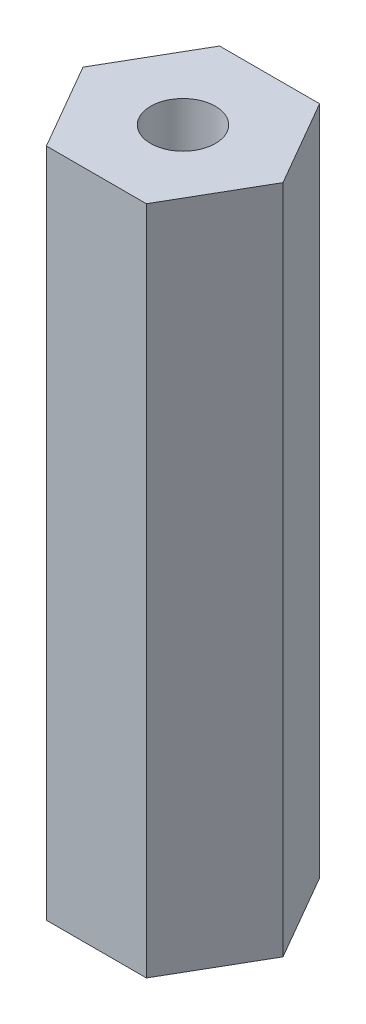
from build123d import *

# Parameters (mm, degrees)
BOSS_EXTRUDE1_DEPTH = 29.499999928
SKETCH2_R           = 1.4224
CUT_EXTRUDE1_DEPTH  = 31.068603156


with BuildPart() as part:
    # Sketch1 → Boss-Extrude1 (new body)
    with BuildSketch(Plane(origin=(0, 0, 0), x_dir=(1, 0, 0), z_dir=(0, 1, 0))):
        Polygon((4.399409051, 0), (2.199704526, 3.81), (-2.199704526, 3.81), (-4.399409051, 0), (-2.199704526, -3.81), (2.199704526, -3.81), align=None)
    extrude(amount=BOSS_EXTRUDE1_DEPTH)

    # Sketch2 → Cut-Extrude1 (cut, through all)
    with BuildSketch(Plane(origin=(0, 0, 0), x_dir=(-1, 0, 0), z_dir=(0, -1, 0))):
        with Locations(Location((0, 0, 0), (0, 0, 90))):
            Circle(SKETCH2_R)
    extrude(amount=-CUT_EXTRUDE1_DEPTH, mode=Mode.SUBTRACT)


solid = part.part
